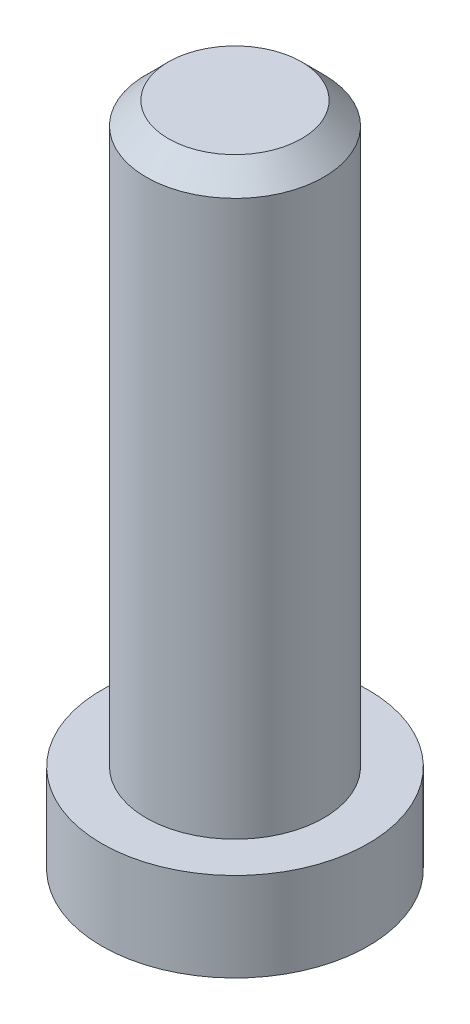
from build123d import *

# Parameters (mm, degrees)
CROQUIS1_R              = 3
SALIENTE_EXTRUIR1_DEPTH = 2
CROQUIS2_R              = 2
SALIENTE_EXTRUIR2_DEPTH = 13
CHAFL_N1_SIZE           = 0.5


with BuildPart() as part:
    # Croquis1 → Saliente-Extruir1 (new body)
    with BuildSketch(Plane(origin=(0, 0, 0), x_dir=(1, 0, 0), z_dir=(0, 1, 0))):
        with Locations(Location((0, 0, 0), (0, 0, 270))):
            Circle(CROQUIS1_R)
    extrude(amount=SALIENTE_EXTRUIR1_DEPTH)

    # Croquis2 → Saliente-Extruir2 (add)
    with BuildSketch(Plane(origin=(0, 2, 0), x_dir=(1, 0, 0), z_dir=(0, 1, 0))):
        with Locations(Location((0, 0, 0), (0, 0, 90))):
            Circle(CROQUIS2_R)
    extrude(amount=SALIENTE_EXTRUIR2_DEPTH)

    # Chafl_n1
    chafl_n1_edges = [part.edges().sort_by_distance(p)[0] for p in [
        (0, 15, 2),
    ]]
    chamfer(chafl_n1_edges, length=CHAFL_N1_SIZE)


solid = part.part
